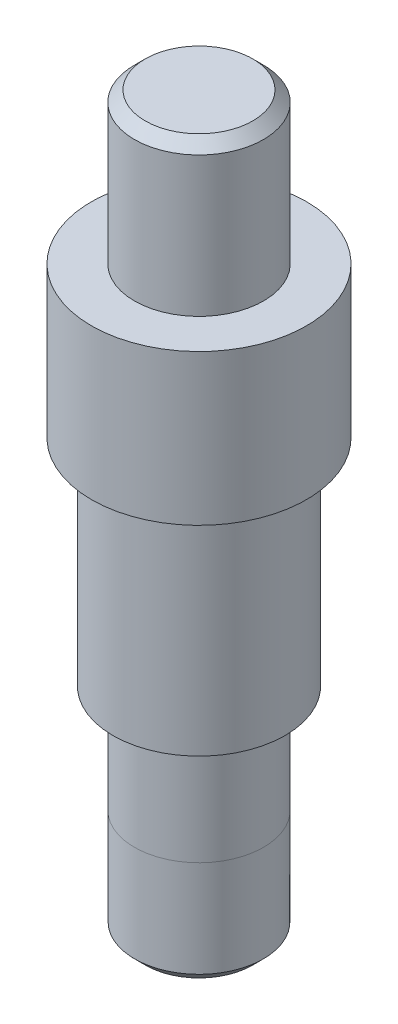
ISO-10303-21;
HEADER;
FILE_DESCRIPTION(('STEP AP214'),'2;1');
FILE_NAME('part.step','',(''),(''),'','','');
FILE_SCHEMA(('AUTOMOTIVE_DESIGN { 1 0 10303 214 1 1 1 1 }'));
ENDSEC;
DATA;
#1=APPLICATION_CONTEXT('core data for automotive mechanical design processes');
#2=APPLICATION_PROTOCOL_DEFINITION('international standard','automotive_design',2000,#1);
#3=PRODUCT_CONTEXT('',#1,'mechanical');
#4=PRODUCT('Part','Part','',(#3));
#5=PRODUCT_RELATED_PRODUCT_CATEGORY('part','',(#4));
#6=PRODUCT_DEFINITION_FORMATION('','',#4);
#7=PRODUCT_DEFINITION_CONTEXT('part definition',#1,'design');
#8=PRODUCT_DEFINITION('design','',#6,#7);
#9=PRODUCT_DEFINITION_SHAPE('','',#8);
#10=(LENGTH_UNIT() NAMED_UNIT(*) SI_UNIT(.MILLI.,.METRE.));
#11=(NAMED_UNIT(*) PLANE_ANGLE_UNIT() SI_UNIT($,.RADIAN.));
#12=(NAMED_UNIT(*) SI_UNIT($,.STERADIAN.) SOLID_ANGLE_UNIT());
#13=UNCERTAINTY_MEASURE_WITH_UNIT(LENGTH_MEASURE(1.E-05),#10,'distance_accuracy_value','');
#14=(GEOMETRIC_REPRESENTATION_CONTEXT(3) GLOBAL_UNCERTAINTY_ASSIGNED_CONTEXT((#13)) GLOBAL_UNIT_ASSIGNED_CONTEXT((#10,
#11,#12)) REPRESENTATION_CONTEXT('',''));
#15=CARTESIAN_POINT('',(0.,0.,0.));
#16=DIRECTION('',(0.,0.,1.));
#17=DIRECTION('',(1.,0.,0.));
#18=AXIS2_PLACEMENT_3D('',#15,#16,#17);
#19=CARTESIAN_POINT('',(0.,-15.,0.));
#20=DIRECTION('',(0.,-1.,0.));
#21=DIRECTION('',(0.,0.,-1.));
#22=AXIS2_PLACEMENT_3D('',#19,#20,#21);
#23=PLANE('',#22);
#24=CARTESIAN_POINT('',(0.,-15.,0.));
#25=DIRECTION('',(0.,-1.,0.));
#26=DIRECTION('',(0.,0.,-1.));
#27=AXIS2_PLACEMENT_3D('',#24,#25,#26);
#28=CIRCLE('',#27,3.);
#29=CARTESIAN_POINT('',(0.,-15.,-3.));
#30=VERTEX_POINT('',#29);
#31=EDGE_CURVE('E65',#30,#30,#28,.T.);
#32=ORIENTED_EDGE('',*,*,#31,.T.);
#33=EDGE_LOOP('',(#32));
#34=FACE_BOUND('',#33,.T.);
#35=CARTESIAN_POINT('',(0.,-15.,0.));
#36=DIRECTION('',(0.,-1.,0.));
#37=DIRECTION('',(0.,0.,-1.));
#38=AXIS2_PLACEMENT_3D('',#35,#36,#37);
#39=CIRCLE('',#38,2.99);
#40=CARTESIAN_POINT('',(0.,-15.,-2.99));
#41=VERTEX_POINT('',#40);
#42=EDGE_CURVE('E71',#41,#41,#39,.T.);
#43=ORIENTED_EDGE('',*,*,#42,.F.);
#44=EDGE_LOOP('',(#43));
#45=FACE_BOUND('',#44,.T.);
#46=ADVANCED_FACE('F30',(#34,#45),#23,.T.);
#47=CARTESIAN_POINT('',(0.,-10.,0.));
#48=DIRECTION('',(0.,-1.,0.));
#49=DIRECTION('',(0.,0.,-1.));
#50=AXIS2_PLACEMENT_3D('',#47,#48,#49);
#51=PLANE('',#50);
#52=CARTESIAN_POINT('',(0.,-10.,0.));
#53=DIRECTION('',(0.,-1.,0.));
#54=DIRECTION('',(0.,0.,-1.));
#55=AXIS2_PLACEMENT_3D('',#52,#53,#54);
#56=CIRCLE('',#55,4.);
#57=CARTESIAN_POINT('',(0.,-10.,-4.));
#58=VERTEX_POINT('',#57);
#59=EDGE_CURVE('E62',#58,#58,#56,.T.);
#60=ORIENTED_EDGE('',*,*,#59,.T.);
#61=EDGE_LOOP('',(#60));
#62=FACE_BOUND('',#61,.T.);
#63=CARTESIAN_POINT('',(0.,-10.,0.));
#64=DIRECTION('',(0.,-1.,0.));
#65=DIRECTION('',(0.,0.,-1.));
#66=AXIS2_PLACEMENT_3D('',#63,#64,#65);
#67=CIRCLE('',#66,3.);
#68=CARTESIAN_POINT('',(0.,-10.,-3.));
#69=VERTEX_POINT('',#68);
#70=EDGE_CURVE('E68',#69,#69,#67,.T.);
#71=ORIENTED_EDGE('',*,*,#70,.F.);
#72=EDGE_LOOP('',(#71));
#73=FACE_BOUND('',#72,.T.);
#74=ADVANCED_FACE('F78',(#62,#73),#51,.T.);
#75=CARTESIAN_POINT('',(0.,0.,0.));
#76=DIRECTION('',(0.,1.,0.));
#77=DIRECTION('',(0.,0.,1.));
#78=AXIS2_PLACEMENT_3D('',#75,#76,#77);
#79=PLANE('',#78);
#80=CARTESIAN_POINT('',(0.,0.,0.));
#81=DIRECTION('',(0.,1.,0.));
#82=DIRECTION('',(0.,0.,1.));
#83=AXIS2_PLACEMENT_3D('',#80,#81,#82);
#84=CIRCLE('',#83,5.);
#85=CARTESIAN_POINT('',(0.,0.,5.));
#86=VERTEX_POINT('',#85);
#87=EDGE_CURVE('E56',#86,#86,#84,.T.);
#88=ORIENTED_EDGE('',*,*,#87,.F.);
#89=EDGE_LOOP('',(#88));
#90=FACE_BOUND('',#89,.T.);
#91=CARTESIAN_POINT('',(0.,0.,0.));
#92=DIRECTION('',(0.,1.,0.));
#93=DIRECTION('',(0.,0.,1.));
#94=AXIS2_PLACEMENT_3D('',#91,#92,#93);
#95=CIRCLE('',#94,4.);
#96=CARTESIAN_POINT('',(0.,0.,4.));
#97=VERTEX_POINT('',#96);
#98=EDGE_CURVE('E50',#97,#97,#95,.F.);
#99=ORIENTED_EDGE('',*,*,#98,.F.);
#100=EDGE_LOOP('',(#99));
#101=FACE_BOUND('',#100,.T.);
#102=ADVANCED_FACE('F84',(#90,#101),#79,.F.);
#103=CARTESIAN_POINT('',(0.,7.,0.));
#104=DIRECTION('',(0.,1.,0.));
#105=DIRECTION('',(0.,0.,1.));
#106=AXIS2_PLACEMENT_3D('',#103,#104,#105);
#107=PLANE('',#106);
#108=CARTESIAN_POINT('',(0.,7.,0.));
#109=DIRECTION('',(0.,1.,0.));
#110=DIRECTION('',(0.,0.,1.));
#111=AXIS2_PLACEMENT_3D('',#108,#109,#110);
#112=CIRCLE('',#111,5.);
#113=CARTESIAN_POINT('',(0.,7.,5.));
#114=VERTEX_POINT('',#113);
#115=EDGE_CURVE('E53',#114,#114,#112,.T.);
#116=ORIENTED_EDGE('',*,*,#115,.T.);
#117=EDGE_LOOP('',(#116));
#118=FACE_BOUND('',#117,.T.);
#119=CARTESIAN_POINT('',(0.,7.,0.));
#120=DIRECTION('',(0.,1.,0.));
#121=DIRECTION('',(0.,0.,1.));
#122=AXIS2_PLACEMENT_3D('',#119,#120,#121);
#123=CIRCLE('',#122,3.);
#124=CARTESIAN_POINT('',(0.,7.,3.));
#125=VERTEX_POINT('',#124);
#126=EDGE_CURVE('E59',#125,#125,#123,.T.);
#127=ORIENTED_EDGE('',*,*,#126,.F.);
#128=EDGE_LOOP('',(#127));
#129=FACE_BOUND('',#128,.T.);
#130=ADVANCED_FACE('F105',(#118,#129),#107,.T.);
#131=CARTESIAN_POINT('',(0.,7.,0.));
#132=DIRECTION('',(0.,-1.,0.));
#133=DIRECTION('',(0.,0.,-1.));
#134=AXIS2_PLACEMENT_3D('',#131,#132,#133);
#135=CYLINDRICAL_SURFACE('',#134,5.);
#136=ORIENTED_EDGE('',*,*,#115,.F.);
#137=EDGE_LOOP('',(#136));
#138=FACE_BOUND('',#137,.T.);
#139=ORIENTED_EDGE('',*,*,#87,.T.);
#140=EDGE_LOOP('',(#139));
#141=FACE_BOUND('',#140,.T.);
#142=ADVANCED_FACE('F32',(#138,#141),#135,.T.);
#143=CARTESIAN_POINT('',(0.,14.,0.));
#144=DIRECTION('',(0.,-1.,0.));
#145=DIRECTION('',(0.,0.,-1.));
#146=AXIS2_PLACEMENT_3D('',#143,#144,#145);
#147=CYLINDRICAL_SURFACE('',#146,3.);
#148=CARTESIAN_POINT('',(0.,13.5,0.));
#149=DIRECTION('',(0.,1.,0.));
#150=DIRECTION('',(0.,0.,1.));
#151=AXIS2_PLACEMENT_3D('',#148,#149,#150);
#152=CIRCLE('',#151,3.);
#153=CARTESIAN_POINT('',(0.,13.5,3.));
#154=VERTEX_POINT('',#153);
#155=EDGE_CURVE('E10',#154,#154,#152,.F.);
#156=ORIENTED_EDGE('',*,*,#155,.T.);
#157=EDGE_LOOP('',(#156));
#158=FACE_BOUND('',#157,.T.);
#159=ORIENTED_EDGE('',*,*,#126,.T.);
#160=EDGE_LOOP('',(#159));
#161=FACE_BOUND('',#160,.T.);
#162=ADVANCED_FACE('F101',(#158,#161),#147,.T.);
#163=CARTESIAN_POINT('',(0.,14.,0.));
#164=DIRECTION('',(0.,1.,0.));
#165=DIRECTION('',(0.,0.,1.));
#166=AXIS2_PLACEMENT_3D('',#163,#164,#165);
#167=PLANE('',#166);
#168=CARTESIAN_POINT('',(0.,14.,0.));
#169=DIRECTION('',(0.,1.,0.));
#170=DIRECTION('',(0.,0.,1.));
#171=AXIS2_PLACEMENT_3D('',#168,#169,#170);
#172=CIRCLE('',#171,2.5);
#173=CARTESIAN_POINT('',(0.,14.,2.5));
#174=VERTEX_POINT('',#173);
#175=EDGE_CURVE('E37',#174,#174,#172,.T.);
#176=ORIENTED_EDGE('',*,*,#175,.T.);
#177=EDGE_LOOP('',(#176));
#178=FACE_BOUND('',#177,.T.);
#179=ADVANCED_FACE('F97',(#178),#167,.T.);
#180=CARTESIAN_POINT('',(0.,-10.,0.));
#181=DIRECTION('',(0.,1.,0.));
#182=DIRECTION('',(0.,0.,1.));
#183=AXIS2_PLACEMENT_3D('',#180,#181,#182);
#184=CYLINDRICAL_SURFACE('',#183,4.);
#185=ORIENTED_EDGE('',*,*,#59,.F.);
#186=EDGE_LOOP('',(#185));
#187=FACE_BOUND('',#186,.T.);
#188=ORIENTED_EDGE('',*,*,#98,.T.);
#189=EDGE_LOOP('',(#188));
#190=FACE_BOUND('',#189,.T.);
#191=ADVANCED_FACE('F92',(#187,#190),#184,.T.);
#192=CARTESIAN_POINT('',(0.,-15.,0.));
#193=DIRECTION('',(0.,1.,0.));
#194=DIRECTION('',(0.,0.,1.));
#195=AXIS2_PLACEMENT_3D('',#192,#193,#194);
#196=CYLINDRICAL_SURFACE('',#195,3.);
#197=ORIENTED_EDGE('',*,*,#31,.F.);
#198=EDGE_LOOP('',(#197));
#199=FACE_BOUND('',#198,.T.);
#200=ORIENTED_EDGE('',*,*,#70,.T.);
#201=EDGE_LOOP('',(#200));
#202=FACE_BOUND('',#201,.T.);
#203=ADVANCED_FACE('F90',(#199,#202),#196,.T.);
#204=CARTESIAN_POINT('',(0.,-20.,0.));
#205=DIRECTION('',(0.,1.,0.));
#206=DIRECTION('',(0.,0.,1.));
#207=AXIS2_PLACEMENT_3D('',#204,#205,#206);
#208=CYLINDRICAL_SURFACE('',#207,2.99);
#209=CARTESIAN_POINT('',(0.,-19.5,0.));
#210=DIRECTION('',(0.,-1.,0.));
#211=DIRECTION('',(0.,0.,-1.));
#212=AXIS2_PLACEMENT_3D('',#209,#210,#211);
#213=CIRCLE('',#212,2.99);
#214=CARTESIAN_POINT('',(0.,-19.5,-2.99));
#215=VERTEX_POINT('',#214);
#216=EDGE_CURVE('E41',#215,#215,#213,.F.);
#217=ORIENTED_EDGE('',*,*,#216,.T.);
#218=EDGE_LOOP('',(#217));
#219=FACE_BOUND('',#218,.T.);
#220=ORIENTED_EDGE('',*,*,#42,.T.);
#221=EDGE_LOOP('',(#220));
#222=FACE_BOUND('',#221,.T.);
#223=ADVANCED_FACE('F75',(#219,#222),#208,.T.);
#224=CARTESIAN_POINT('',(0.,-20.,0.));
#225=DIRECTION('',(0.,-1.,0.));
#226=DIRECTION('',(0.,0.,-1.));
#227=AXIS2_PLACEMENT_3D('',#224,#225,#226);
#228=PLANE('',#227);
#229=CARTESIAN_POINT('',(0.,-20.,0.));
#230=DIRECTION('',(0.,-1.,0.));
#231=DIRECTION('',(0.,0.,-1.));
#232=AXIS2_PLACEMENT_3D('',#229,#230,#231);
#233=CIRCLE('',#232,2.49000000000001);
#234=CARTESIAN_POINT('',(0.,-20.,-2.49000000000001));
#235=VERTEX_POINT('',#234);
#236=EDGE_CURVE('E45',#235,#235,#233,.T.);
#237=ORIENTED_EDGE('',*,*,#236,.T.);
#238=EDGE_LOOP('',(#237));
#239=FACE_BOUND('',#238,.T.);
#240=ADVANCED_FACE('F148',(#239),#228,.T.);
#241=CARTESIAN_POINT('',(0.,-20.,0.));
#242=DIRECTION('',(0.,1.,0.));
#243=DIRECTION('',(0.,0.,1.));
#244=AXIS2_PLACEMENT_3D('',#241,#242,#243);
#245=CONICAL_SURFACE('',#244,2.49000000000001,0.785398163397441);
#246=ORIENTED_EDGE('',*,*,#216,.F.);
#247=EDGE_LOOP('',(#246));
#248=FACE_BOUND('',#247,.T.);
#249=ORIENTED_EDGE('',*,*,#236,.F.);
#250=EDGE_LOOP('',(#249));
#251=FACE_BOUND('',#250,.T.);
#252=ADVANCED_FACE('F153',(#248,#251),#245,.T.);
#253=CARTESIAN_POINT('',(0.,14.,0.));
#254=DIRECTION('',(0.,-1.,0.));
#255=DIRECTION('',(0.,0.,-1.));
#256=AXIS2_PLACEMENT_3D('',#253,#254,#255);
#257=CONICAL_SURFACE('',#256,2.5,0.785398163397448);
#258=ORIENTED_EDGE('',*,*,#155,.F.);
#259=EDGE_LOOP('',(#258));
#260=FACE_BOUND('',#259,.T.);
#261=ORIENTED_EDGE('',*,*,#175,.F.);
#262=EDGE_LOOP('',(#261));
#263=FACE_BOUND('',#262,.T.);
#264=ADVANCED_FACE('F160',(#260,#263),#257,.T.);
#265=CLOSED_SHELL('',(#46,#74,#102,#130,#142,#162,#179,#191,#203,#223,#240,#252,#264));
#266=MANIFOLD_SOLID_BREP('B2',#265);
#267=ADVANCED_BREP_SHAPE_REPRESENTATION('',(#18,#266),#14);
#268=SHAPE_DEFINITION_REPRESENTATION(#9,#267);
ENDSEC;
END-ISO-10303-21;
